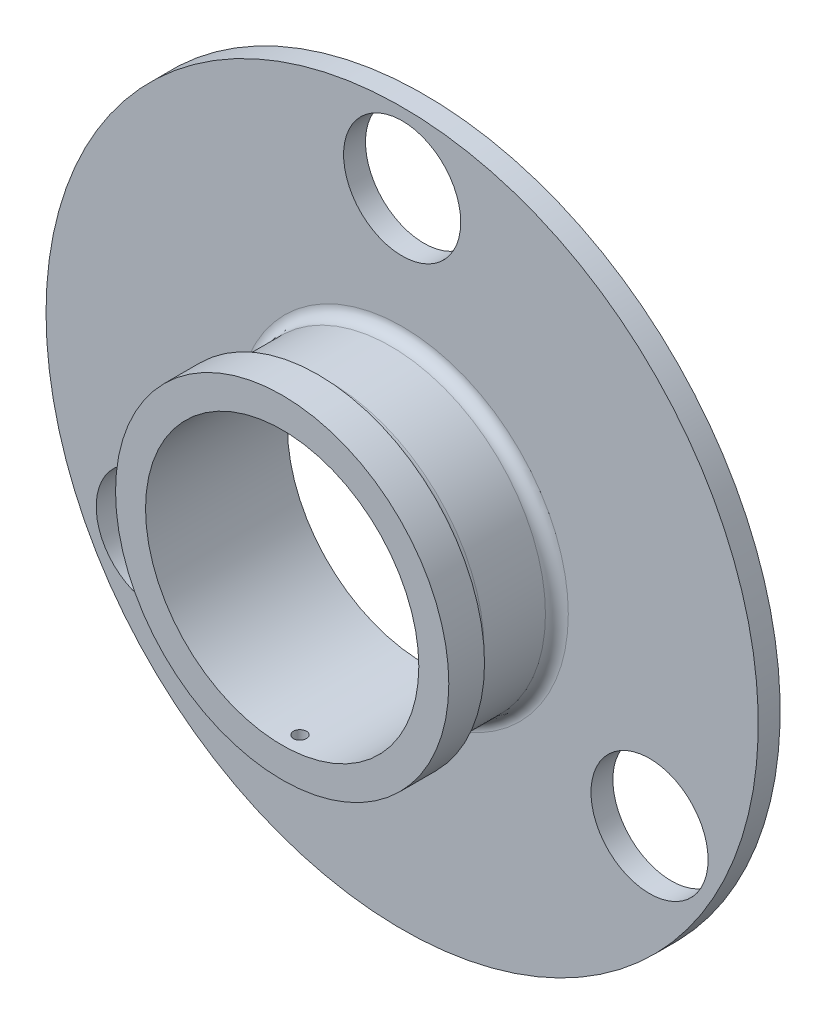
ISO-10303-21;
HEADER;
FILE_DESCRIPTION(('STEP AP214'),'2;1');
FILE_NAME('part.step','',(''),(''),'','','');
FILE_SCHEMA(('AUTOMOTIVE_DESIGN { 1 0 10303 214 1 1 1 1 }'));
ENDSEC;
DATA;
#1=APPLICATION_CONTEXT('core data for automotive mechanical design processes');
#2=APPLICATION_PROTOCOL_DEFINITION('international standard','automotive_design',2000,#1);
#3=PRODUCT_CONTEXT('',#1,'mechanical');
#4=PRODUCT('Part','Part','',(#3));
#5=PRODUCT_RELATED_PRODUCT_CATEGORY('part','',(#4));
#6=PRODUCT_DEFINITION_FORMATION('','',#4);
#7=PRODUCT_DEFINITION_CONTEXT('part definition',#1,'design');
#8=PRODUCT_DEFINITION('design','',#6,#7);
#9=PRODUCT_DEFINITION_SHAPE('','',#8);
#10=(LENGTH_UNIT() NAMED_UNIT(*) SI_UNIT(.MILLI.,.METRE.));
#11=(NAMED_UNIT(*) PLANE_ANGLE_UNIT() SI_UNIT($,.RADIAN.));
#12=(NAMED_UNIT(*) SI_UNIT($,.STERADIAN.) SOLID_ANGLE_UNIT());
#13=UNCERTAINTY_MEASURE_WITH_UNIT(LENGTH_MEASURE(1.E-05),#10,'distance_accuracy_value','');
#14=(GEOMETRIC_REPRESENTATION_CONTEXT(3) GLOBAL_UNCERTAINTY_ASSIGNED_CONTEXT((#13)) GLOBAL_UNIT_ASSIGNED_CONTEXT((#10,
#11,#12)) REPRESENTATION_CONTEXT('',''));
#15=CARTESIAN_POINT('',(0.,0.,0.));
#16=DIRECTION('',(0.,0.,1.));
#17=DIRECTION('',(1.,0.,0.));
#18=AXIS2_PLACEMENT_3D('',#15,#16,#17);
#19=CARTESIAN_POINT('',(0.,0.,0.));
#20=DIRECTION('',(0.,0.,-1.));
#21=DIRECTION('',(-1.,0.,0.));
#22=AXIS2_PLACEMENT_3D('',#19,#20,#21);
#23=CYLINDRICAL_SURFACE('',#22,36.449);
#24=CARTESIAN_POINT('',(0.,-36.449,31.3563));
#25=CARTESIAN_POINT('',(0.0969591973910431,-36.4489994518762,31.3563042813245));
#26=CARTESIAN_POINT('',(0.193987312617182,-36.4486089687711,31.3644918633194));
#27=CARTESIAN_POINT('',(0.385367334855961,-36.4470887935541,31.3970378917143));
#28=CARTESIAN_POINT('',(0.479715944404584,-36.4459582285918,31.4214154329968));
#29=CARTESIAN_POINT('',(0.662936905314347,-36.4430858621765,31.4856422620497));
#30=CARTESIAN_POINT('',(0.751812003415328,-36.4413443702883,31.5254837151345));
#31=CARTESIAN_POINT('',(0.921588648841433,-36.4374463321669,31.6194955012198));
#32=CARTESIAN_POINT('',(1.00249208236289,-36.4352898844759,31.6736624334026));
#33=CARTESIAN_POINT('',(1.15412766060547,-36.4308023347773,31.7948434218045));
#34=CARTESIAN_POINT('',(1.22485156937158,-36.428471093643,31.8618677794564));
#35=CARTESIAN_POINT('',(1.35405039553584,-36.4238979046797,32.0068406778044));
#36=CARTESIAN_POINT('',(1.41252481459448,-36.4216559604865,32.084789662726));
#37=CARTESIAN_POINT('',(1.5155867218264,-36.4175132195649,32.2494413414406));
#38=CARTESIAN_POINT('',(1.56016789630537,-36.415612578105,32.3361479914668));
#39=CARTESIAN_POINT('',(1.63413727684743,-36.4123684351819,32.5158258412));
#40=CARTESIAN_POINT('',(1.66352558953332,-36.4110249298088,32.6087969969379));
#41=CARTESIAN_POINT('',(1.70625358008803,-36.4090477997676,32.798290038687));
#42=CARTESIAN_POINT('',(1.71960541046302,-36.4084136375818,32.8948091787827));
#43=CARTESIAN_POINT('',(1.72991891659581,-36.4079250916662,33.0887207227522));
#44=CARTESIAN_POINT('',(1.72688071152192,-36.4080707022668,33.1861131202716));
#45=CARTESIAN_POINT('',(1.70451052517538,-36.4091247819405,33.3789239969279));
#46=CARTESIAN_POINT('',(1.68519167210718,-36.4100326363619,33.4743440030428));
#47=CARTESIAN_POINT('',(1.63082892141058,-36.4125079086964,33.6605851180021));
#48=CARTESIAN_POINT('',(1.5957849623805,-36.414075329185,33.7514062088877));
#49=CARTESIAN_POINT('',(1.51095176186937,-36.417693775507,33.9259137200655));
#50=CARTESIAN_POINT('',(1.46115652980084,-36.4197449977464,34.0095972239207));
#51=CARTESIAN_POINT('',(1.34823865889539,-36.4240996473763,34.1674221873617));
#52=CARTESIAN_POINT('',(1.28511593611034,-36.4264030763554,34.2415635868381));
#53=CARTESIAN_POINT('',(1.14726079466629,-36.4310052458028,34.378276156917));
#54=CARTESIAN_POINT('',(1.07251700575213,-36.4333039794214,34.4408358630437));
#55=CARTESIAN_POINT('',(0.913581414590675,-36.4376354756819,34.5525208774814));
#56=CARTESIAN_POINT('',(0.829389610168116,-36.4396682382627,34.6016461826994));
#57=CARTESIAN_POINT('',(0.653941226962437,-36.4432387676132,34.6850667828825));
#58=CARTESIAN_POINT('',(0.562684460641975,-36.4447765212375,34.7193616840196));
#59=CARTESIAN_POINT('',(0.375699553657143,-36.4471835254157,34.7721405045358));
#60=CARTESIAN_POINT('',(0.279971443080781,-36.4480527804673,34.7906245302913));
#61=CARTESIAN_POINT('',(0.0868607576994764,-36.4490242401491,34.811242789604));
#62=CARTESIAN_POINT('',(-0.0105201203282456,-36.4491271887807,34.8133928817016));
#63=CARTESIAN_POINT('',(-0.204259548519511,-36.4485564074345,34.8013236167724));
#64=CARTESIAN_POINT('',(-0.30061810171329,-36.4478826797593,34.7871043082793));
#65=CARTESIAN_POINT('',(-0.489533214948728,-36.4458349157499,34.7427130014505));
#66=CARTESIAN_POINT('',(-0.582091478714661,-36.4444611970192,34.7125482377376));
#67=CARTESIAN_POINT('',(-0.760831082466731,-36.4411681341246,34.6371296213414));
#68=CARTESIAN_POINT('',(-0.847012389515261,-36.4392487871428,34.5918756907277));
#69=CARTESIAN_POINT('',(-1.01062455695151,-36.4350785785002,34.4875226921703));
#70=CARTESIAN_POINT('',(-1.08804862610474,-36.4328274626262,34.428412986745));
#71=CARTESIAN_POINT('',(-1.23188026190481,-36.4282481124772,34.2980418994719));
#72=CARTESIAN_POINT('',(-1.29828776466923,-36.4259198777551,34.2267804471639));
#73=CARTESIAN_POINT('',(-1.41825452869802,-36.4214465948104,34.0740605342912));
#74=CARTESIAN_POINT('',(-1.47180353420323,-36.4193016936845,33.9925940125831));
#75=CARTESIAN_POINT('',(-1.56446315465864,-36.4154392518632,33.8218172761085));
#76=CARTESIAN_POINT('',(-1.60357382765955,-36.4137217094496,33.73250709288));
#77=CARTESIAN_POINT('',(-1.66622867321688,-36.410908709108,33.5486163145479));
#78=CARTESIAN_POINT('',(-1.68977939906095,-36.4098129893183,33.4540379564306));
#79=CARTESIAN_POINT('',(-1.72066727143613,-36.4083664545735,33.262264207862));
#80=CARTESIAN_POINT('',(-1.72800449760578,-36.4080156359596,33.1650688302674));
#81=CARTESIAN_POINT('',(-1.72625632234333,-36.4080985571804,32.9709221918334));
#82=CARTESIAN_POINT('',(-1.71718705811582,-36.4085315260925,32.8739707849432));
#83=CARTESIAN_POINT('',(-1.68291668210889,-36.4101315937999,32.6829686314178));
#84=CARTESIAN_POINT('',(-1.6577155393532,-36.4112986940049,32.5889178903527));
#85=CARTESIAN_POINT('',(-1.59189998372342,-36.4142353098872,32.4063832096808));
#86=CARTESIAN_POINT('',(-1.55128542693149,-36.4160048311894,32.3178993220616));
#87=CARTESIAN_POINT('',(-1.45579890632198,-36.4199467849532,32.1490056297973));
#88=CARTESIAN_POINT('',(-1.4009273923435,-36.4221192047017,32.0685955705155));
#89=CARTESIAN_POINT('',(-1.27842740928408,-36.4266245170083,31.9180518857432));
#90=CARTESIAN_POINT('',(-1.21078782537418,-36.4289575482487,31.8479273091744));
#91=CARTESIAN_POINT('',(-1.06467652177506,-36.433520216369,31.7200072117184));
#92=CARTESIAN_POINT('',(-0.986202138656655,-36.4357498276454,31.6622147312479));
#93=CARTESIAN_POINT('',(-0.820592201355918,-36.4398558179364,31.560575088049));
#94=CARTESIAN_POINT('',(-0.733448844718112,-36.44173187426,31.5167406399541));
#95=CARTESIAN_POINT('',(-0.553096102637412,-36.4449144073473,31.4443770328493));
#96=CARTESIAN_POINT('',(-0.45989404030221,-36.4462215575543,31.4158297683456));
#97=CARTESIAN_POINT('',(-0.305092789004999,-36.4477726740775,31.3823512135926));
#98=CARTESIAN_POINT('',(-0.244496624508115,-36.4482309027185,31.3725944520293));
#99=CARTESIAN_POINT('',(-0.122609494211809,-36.4488447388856,31.3595674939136));
#100=CARTESIAN_POINT('',(-0.0613185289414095,-36.4490003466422,31.3562972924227));
#101=CARTESIAN_POINT('',(0.,-36.449,31.3563));
#102=B_SPLINE_CURVE_WITH_KNOTS('',3,(#24,#25,#26,#27,#28,#29,#30,#31,#32,#33,#34,#35,#36,#37,
#38,#39,#40,#41,#42,#43,#44,#45,#46,#47,#48,#49,#50,#51,#52,#53,#54,#55,#56,#57,#58,#59,#60,#61,
#62,#63,#64,#65,#66,#67,#68,#69,#70,#71,#72,#73,#74,#75,#76,#77,#78,#79,#80,#81,#82,#83,#84,#85,
#86,#87,#88,#89,#90,#91,#92,#93,#94,#95,#96,#97,#98,#99,#100,#101),.UNSPECIFIED.,.T.,.F.,(4,2,2,
2,2,2,2,2,2,2,2,2,2,2,2,2,2,2,2,2,2,2,2,2,2,2,2,2,2,2,2,2,2,2,2,2,2,2,4),(0.,0.290653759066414,
0.581650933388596,0.872500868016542,1.16328181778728,1.45429672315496,1.74532346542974,
2.03648227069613,2.32763903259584,2.6185750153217,2.90950888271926,3.20020837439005,
3.49090900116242,3.7817278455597,4.07254852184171,4.36365555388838,4.65476265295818,
4.9458774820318,5.23699035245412,5.5278205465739,5.81864987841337,6.10934737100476,
6.40004636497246,6.69096927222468,6.98189386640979,7.2730497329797,7.56420442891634,
7.85523642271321,8.14626698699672,8.43701145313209,8.72775647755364,9.01850421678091,
9.30924278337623,9.6002356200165,9.89130011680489,10.1826289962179,10.4736120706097,
10.6574262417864,10.8412402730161),.UNSPECIFIED.);
#103=CARTESIAN_POINT('',(0.,-36.449,31.3563));
#104=VERTEX_POINT('',#103);
#105=EDGE_CURVE('E97',#104,#104,#102,.T.);
#106=ORIENTED_EDGE('',*,*,#105,.T.);
#107=EDGE_LOOP('',(#106));
#108=FACE_BOUND('',#107,.T.);
#109=CARTESIAN_POINT('',(0.,0.,37.846));
#110=DIRECTION('',(0.,0.,-1.));
#111=DIRECTION('',(-1.,0.,0.));
#112=AXIS2_PLACEMENT_3D('',#109,#110,#111);
#113=CIRCLE('',#112,36.449);
#114=CARTESIAN_POINT('',(-36.449,0.,37.846));
#115=VERTEX_POINT('',#114);
#116=EDGE_CURVE('E10',#115,#115,#113,.T.);
#117=ORIENTED_EDGE('',*,*,#116,.F.);
#118=EDGE_LOOP('',(#117));
#119=FACE_BOUND('',#118,.T.);
#120=CARTESIAN_POINT('',(0.,0.,0.));
#121=DIRECTION('',(0.,0.,-1.));
#122=DIRECTION('',(-1.,0.,0.));
#123=AXIS2_PLACEMENT_3D('',#120,#121,#122);
#124=CIRCLE('',#123,36.449);
#125=CARTESIAN_POINT('',(-36.449,0.,0.));
#126=VERTEX_POINT('',#125);
#127=EDGE_CURVE('E69',#126,#126,#124,.T.);
#128=ORIENTED_EDGE('',*,*,#127,.T.);
#129=EDGE_LOOP('',(#128));
#130=FACE_BOUND('',#129,.T.);
#131=ADVANCED_FACE('F35',(#108,#119,#130),#23,.F.);
#132=CARTESIAN_POINT('',(44.45,0.,37.846));
#133=DIRECTION('',(0.,0.,-1.));
#134=DIRECTION('',(-1.,0.,0.));
#135=AXIS2_PLACEMENT_3D('',#132,#133,#134);
#136=PLANE('',#135);
#137=CARTESIAN_POINT('',(0.,0.,37.846));
#138=DIRECTION('',(0.,0.,-1.));
#139=DIRECTION('',(-1.,0.,0.));
#140=AXIS2_PLACEMENT_3D('',#137,#138,#139);
#141=CIRCLE('',#140,44.45);
#142=CARTESIAN_POINT('',(-44.45,0.,37.846));
#143=VERTEX_POINT('',#142);
#144=EDGE_CURVE('E41',#143,#143,#141,.T.);
#145=ORIENTED_EDGE('',*,*,#144,.F.);
#146=EDGE_LOOP('',(#145));
#147=FACE_BOUND('',#146,.T.);
#148=ORIENTED_EDGE('',*,*,#116,.T.);
#149=EDGE_LOOP('',(#148));
#150=FACE_BOUND('',#149,.T.);
#151=ADVANCED_FACE('F152',(#147,#150),#136,.F.);
#152=CARTESIAN_POINT('',(0.,0.,0.));
#153=DIRECTION('',(0.,0.,-1.));
#154=DIRECTION('',(-1.,0.,0.));
#155=AXIS2_PLACEMENT_3D('',#152,#153,#154);
#156=CYLINDRICAL_SURFACE('',#155,44.45);
#157=CARTESIAN_POINT('',(0.,-44.45,31.3563));
#158=CARTESIAN_POINT('',(-0.0969783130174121,-44.4499995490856,31.35630428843));
#159=CARTESIAN_POINT('',(-0.19402601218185,-44.4496792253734,31.364495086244));
#160=CARTESIAN_POINT('',(-0.38544597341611,-44.4484321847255,31.397054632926));
#161=CARTESIAN_POINT('',(-0.479814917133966,-44.447504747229,31.4214426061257));
#162=CARTESIAN_POINT('',(-0.66307664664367,-44.4451484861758,31.4856987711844));
#163=CARTESIAN_POINT('',(-0.751972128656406,-44.4437199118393,31.5255592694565));
#164=CARTESIAN_POINT('',(-0.921785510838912,-44.4405224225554,31.619617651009));
#165=CARTESIAN_POINT('',(-1.00270532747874,-44.4387535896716,31.6738120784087));
#166=CARTESIAN_POINT('',(-1.15434895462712,-44.4350733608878,31.7950411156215));
#167=CARTESIAN_POINT('',(-1.22506686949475,-44.4331618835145,31.8620830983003));
#168=CARTESIAN_POINT('',(-1.35424930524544,-44.4294125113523,32.0070902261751));
#169=CARTESIAN_POINT('',(-1.41271333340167,-44.4275746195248,32.0850558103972));
#170=CARTESIAN_POINT('',(-1.51574171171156,-44.4241791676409,32.2497241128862));
#171=CARTESIAN_POINT('',(-1.5603019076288,-44.4226216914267,32.3364294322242));
#172=CARTESIAN_POINT('',(-1.63423093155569,-44.4199635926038,32.5160975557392));
#173=CARTESIAN_POINT('',(-1.66359984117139,-44.4188629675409,32.6090603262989));
#174=CARTESIAN_POINT('',(-1.70629826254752,-44.417243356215,32.7985543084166));
#175=CARTESIAN_POINT('',(-1.71963593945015,-44.4167240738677,32.8950836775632));
#176=CARTESIAN_POINT('',(-1.72991846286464,-44.4163248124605,33.0890125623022));
#177=CARTESIAN_POINT('',(-1.72686339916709,-44.4164448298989,33.1864120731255));
#178=CARTESIAN_POINT('',(-1.70445400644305,-44.4173103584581,33.3792610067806));
#179=CARTESIAN_POINT('',(-1.68510849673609,-44.4180555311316,33.4747114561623));
#180=CARTESIAN_POINT('',(-1.63068101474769,-44.4200868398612,33.6610089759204));
#181=CARTESIAN_POINT('',(-1.59559899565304,-44.4213729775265,33.7518560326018));
#182=CARTESIAN_POINT('',(-1.51068423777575,-44.424341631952,33.9263963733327));
#183=CARTESIAN_POINT('',(-1.46084746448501,-44.4260242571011,34.0100876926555));
#184=CARTESIAN_POINT('',(-1.34784084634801,-44.4295961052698,34.1679193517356));
#185=CARTESIAN_POINT('',(-1.2846709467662,-44.4314853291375,34.2420596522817));
#186=CARTESIAN_POINT('',(-1.14674139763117,-44.435258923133,34.3787360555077));
#187=CARTESIAN_POINT('',(-1.07197410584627,-44.4371432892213,34.4412644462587));
#188=CARTESIAN_POINT('',(-0.912999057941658,-44.4406935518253,34.5528826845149));
#189=CARTESIAN_POINT('',(-0.828791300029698,-44.4423594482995,34.6019725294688));
#190=CARTESIAN_POINT('',(-0.653321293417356,-44.4452850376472,34.6853193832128));
#191=CARTESIAN_POINT('',(-0.562058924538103,-44.4465447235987,34.7195761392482));
#192=CARTESIAN_POINT('',(-0.375072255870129,-44.4485157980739,34.7722794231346));
#193=CARTESIAN_POINT('',(-0.279347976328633,-44.4492271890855,34.7907260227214));
#194=CARTESIAN_POINT('',(-0.0862217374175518,-44.4500211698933,34.8112758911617));
#195=CARTESIAN_POINT('',(0.0111790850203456,-44.4501041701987,34.8133898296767));
#196=CARTESIAN_POINT('',(0.204952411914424,-44.4496331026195,34.801242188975));
#197=CARTESIAN_POINT('',(0.30132491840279,-44.4490790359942,34.786980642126));
#198=CARTESIAN_POINT('',(0.490276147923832,-44.4473965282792,34.7424956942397));
#199=CARTESIAN_POINT('',(0.582856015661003,-44.4462682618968,34.7122771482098));
#200=CARTESIAN_POINT('',(0.761629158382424,-44.4435644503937,34.6367409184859));
#201=CARTESIAN_POINT('',(0.847822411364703,-44.4419889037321,34.591423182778));
#202=CARTESIAN_POINT('',(1.0114246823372,-44.4385669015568,34.4869475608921));
#203=CARTESIAN_POINT('',(1.08882911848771,-44.4367203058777,34.4277825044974));
#204=CARTESIAN_POINT('',(1.23261049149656,-44.4329647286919,34.2973022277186));
#205=CARTESIAN_POINT('',(1.29898738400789,-44.4310557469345,34.225986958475));
#206=CARTESIAN_POINT('',(1.41886522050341,-44.4273894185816,34.0731848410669));
#207=CARTESIAN_POINT('',(1.47235927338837,-44.4256321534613,33.9916925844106));
#208=CARTESIAN_POINT('',(1.56490583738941,-44.4224686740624,33.8208772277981));
#209=CARTESIAN_POINT('',(1.60395839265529,-44.4210624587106,33.7315541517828));
#210=CARTESIAN_POINT('',(1.66650134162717,-44.4187602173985,33.5476384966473));
#211=CARTESIAN_POINT('',(1.68999616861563,-44.4178640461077,33.4530474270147));
#212=CARTESIAN_POINT('',(1.72077124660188,-44.4166825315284,33.2612596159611));
#213=CARTESIAN_POINT('',(1.72805154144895,-44.416397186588,33.1640628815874));
#214=CARTESIAN_POINT('',(1.72619039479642,-44.416469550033,32.9698915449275));
#215=CARTESIAN_POINT('',(1.71705980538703,-44.4168268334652,32.8729168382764));
#216=CARTESIAN_POINT('',(1.6826584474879,-44.41814328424,32.6818779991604));
#217=CARTESIAN_POINT('',(1.65738764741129,-44.4191024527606,32.5878138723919));
#218=CARTESIAN_POINT('',(1.59142513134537,-44.4215144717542,32.4052632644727));
#219=CARTESIAN_POINT('',(1.55073319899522,-44.4229673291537,32.3167768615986));
#220=CARTESIAN_POINT('',(1.45508607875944,-44.4262029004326,32.1478924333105));
#221=CARTESIAN_POINT('',(1.40013137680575,-44.4279856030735,32.0674941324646));
#222=CARTESIAN_POINT('',(1.27748233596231,-44.4316812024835,31.9170155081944));
#223=CARTESIAN_POINT('',(1.20978095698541,-44.4335941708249,31.8469409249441));
#224=CARTESIAN_POINT('',(1.06355515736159,-44.4373343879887,31.7191318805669));
#225=CARTESIAN_POINT('',(0.98502806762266,-44.4391616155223,31.6614004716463));
#226=CARTESIAN_POINT('',(0.819337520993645,-44.4425252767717,31.559900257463));
#227=CARTESIAN_POINT('',(0.732167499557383,-44.444061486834,31.5161421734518));
#228=CARTESIAN_POINT('',(0.551778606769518,-44.4466662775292,31.4439337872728));
#229=CARTESIAN_POINT('',(0.45856707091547,-44.4477354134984,31.415465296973));
#230=CARTESIAN_POINT('',(0.303975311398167,-44.4490009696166,31.3821593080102));
#231=CARTESIAN_POINT('',(0.243597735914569,-44.4493739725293,31.372474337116));
#232=CARTESIAN_POINT('',(0.122155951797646,-44.4498736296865,31.3595433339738));
#233=CARTESIAN_POINT('',(0.0610917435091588,-44.4500002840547,31.3562972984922));
#234=CARTESIAN_POINT('',(0.,-44.45,31.3563));
#235=B_SPLINE_CURVE_WITH_KNOTS('',3,(#157,#158,#159,#160,#161,#162,#163,#164,#165,#166,#167,
#168,#169,#170,#171,#172,#173,#174,#175,#176,#177,#178,#179,#180,#181,#182,#183,#184,#185,#186,
#187,#188,#189,#190,#191,#192,#193,#194,#195,#196,#197,#198,#199,#200,#201,#202,#203,#204,#205,
#206,#207,#208,#209,#210,#211,#212,#213,#214,#215,#216,#217,#218,#219,#220,#221,#222,#223,#224,
#225,#226,#227,#228,#229,#230,#231,#232,#233,#234),.UNSPECIFIED.,.T.,.F.,(4,2,2,2,2,2,2,2,2,2,2,
2,2,2,2,2,2,2,2,2,2,2,2,2,2,2,2,2,2,2,2,2,2,2,2,2,2,2,4),(0.,0.290711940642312,
0.581769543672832,0.872682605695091,1.16352559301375,1.45453598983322,1.74555808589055,
2.03666705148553,2.32777445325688,2.61873352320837,2.90969099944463,3.20049105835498,
3.49129198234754,3.78217249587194,4.07305420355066,4.36412841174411,4.65520267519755,
4.94628189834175,5.23735980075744,5.5282475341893,5.81913469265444,6.10993339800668,
6.40073310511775,6.69168372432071,6.98263551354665,7.27374259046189,7.5648487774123,
7.8558719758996,8.14689438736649,8.43772442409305,8.72855502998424,9.01938971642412,
9.31021449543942,9.60120037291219,9.89225812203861,10.1835386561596,10.4744719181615,
10.6576067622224,10.8407415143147),.UNSPECIFIED.);
#236=CARTESIAN_POINT('',(0.,-44.45,31.3563));
#237=VERTEX_POINT('',#236);
#238=EDGE_CURVE('E90',#237,#237,#235,.T.);
#239=ORIENTED_EDGE('',*,*,#238,.T.);
#240=EDGE_LOOP('',(#239));
#241=FACE_BOUND('',#240,.T.);
#242=CARTESIAN_POINT('',(0.,0.,28.321));
#243=DIRECTION('',(0.,0.,-1.));
#244=DIRECTION('',(-1.,0.,0.));
#245=AXIS2_PLACEMENT_3D('',#242,#243,#244);
#246=CIRCLE('',#245,44.45);
#247=CARTESIAN_POINT('',(-44.45,0.,28.321));
#248=VERTEX_POINT('',#247);
#249=EDGE_CURVE('E45',#248,#248,#246,.T.);
#250=ORIENTED_EDGE('',*,*,#249,.F.);
#251=EDGE_LOOP('',(#250));
#252=FACE_BOUND('',#251,.T.);
#253=ORIENTED_EDGE('',*,*,#144,.T.);
#254=EDGE_LOOP('',(#253));
#255=FACE_BOUND('',#254,.T.);
#256=ADVANCED_FACE('F101',(#241,#252,#255),#156,.T.);
#257=CARTESIAN_POINT('',(44.323,0.,28.321));
#258=DIRECTION('',(0.,0.,1.));
#259=DIRECTION('',(1.,0.,0.));
#260=AXIS2_PLACEMENT_3D('',#257,#258,#259);
#261=PLANE('',#260);
#262=CARTESIAN_POINT('',(0.,0.,28.321));
#263=DIRECTION('',(0.,0.,-1.));
#264=DIRECTION('',(-1.,0.,0.));
#265=AXIS2_PLACEMENT_3D('',#262,#263,#264);
#266=CIRCLE('',#265,44.323);
#267=CARTESIAN_POINT('',(-44.323,0.,28.321));
#268=VERTEX_POINT('',#267);
#269=EDGE_CURVE('E49',#268,#268,#266,.T.);
#270=ORIENTED_EDGE('',*,*,#269,.F.);
#271=EDGE_LOOP('',(#270));
#272=FACE_BOUND('',#271,.T.);
#273=ORIENTED_EDGE('',*,*,#249,.T.);
#274=EDGE_LOOP('',(#273));
#275=FACE_BOUND('',#274,.T.);
#276=ADVANCED_FACE('F145',(#272,#275),#261,.F.);
#277=CARTESIAN_POINT('',(0.,0.,25.273));
#278=DIRECTION('',(0.,0.,-1.));
#279=DIRECTION('',(-1.,0.,0.));
#280=AXIS2_PLACEMENT_3D('',#277,#278,#279);
#281=TOROIDAL_SURFACE('',#280,44.323,3.048);
#282=CARTESIAN_POINT('',(0.,0.,25.273));
#283=DIRECTION('',(0.,0.,-1.));
#284=DIRECTION('',(-1.,0.,0.));
#285=AXIS2_PLACEMENT_3D('',#282,#283,#284);
#286=CIRCLE('',#285,41.275);
#287=CARTESIAN_POINT('',(-41.275,0.,25.273));
#288=VERTEX_POINT('',#287);
#289=EDGE_CURVE('E54',#288,#288,#286,.T.);
#290=ORIENTED_EDGE('',*,*,#289,.F.);
#291=EDGE_LOOP('',(#290));
#292=FACE_BOUND('',#291,.T.);
#293=ORIENTED_EDGE('',*,*,#269,.T.);
#294=EDGE_LOOP('',(#293));
#295=FACE_BOUND('',#294,.T.);
#296=ADVANCED_FACE('F142',(#292,#295),#281,.F.);
#297=CARTESIAN_POINT('',(0.,0.,0.));
#298=DIRECTION('',(0.,0.,-1.));
#299=DIRECTION('',(-1.,0.,0.));
#300=AXIS2_PLACEMENT_3D('',#297,#298,#299);
#301=CYLINDRICAL_SURFACE('',#300,41.275);
#302=CARTESIAN_POINT('',(0.,0.,8.89000000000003));
#303=DIRECTION('',(0.,0.,-1.));
#304=DIRECTION('',(-1.,0.,0.));
#305=AXIS2_PLACEMENT_3D('',#302,#303,#304);
#306=CIRCLE('',#305,41.275);
#307=CARTESIAN_POINT('',(-41.275,0.,8.89000000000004));
#308=VERTEX_POINT('',#307);
#309=EDGE_CURVE('E57',#308,#308,#306,.T.);
#310=ORIENTED_EDGE('',*,*,#309,.F.);
#311=EDGE_LOOP('',(#310));
#312=FACE_BOUND('',#311,.T.);
#313=ORIENTED_EDGE('',*,*,#289,.T.);
#314=EDGE_LOOP('',(#313));
#315=FACE_BOUND('',#314,.T.);
#316=ADVANCED_FACE('F138',(#312,#315),#301,.T.);
#317=CARTESIAN_POINT('',(0.,0.,8.89000000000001));
#318=DIRECTION('',(0.,0.,-1.));
#319=DIRECTION('',(-1.,0.,0.));
#320=AXIS2_PLACEMENT_3D('',#317,#318,#319);
#321=TOROIDAL_SURFACE('',#320,44.323,3.048);
#322=CARTESIAN_POINT('',(0.,0.,5.84200000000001));
#323=DIRECTION('',(0.,0.,-1.));
#324=DIRECTION('',(-1.,0.,0.));
#325=AXIS2_PLACEMENT_3D('',#322,#323,#324);
#326=CIRCLE('',#325,44.323);
#327=CARTESIAN_POINT('',(-44.323,0.,5.84200000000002));
#328=VERTEX_POINT('',#327);
#329=EDGE_CURVE('E60',#328,#328,#326,.T.);
#330=ORIENTED_EDGE('',*,*,#329,.F.);
#331=EDGE_LOOP('',(#330));
#332=FACE_BOUND('',#331,.T.);
#333=ORIENTED_EDGE('',*,*,#309,.T.);
#334=EDGE_LOOP('',(#333));
#335=FACE_BOUND('',#334,.T.);
#336=ADVANCED_FACE('F134',(#332,#335),#321,.F.);
#337=CARTESIAN_POINT('',(94.996,0.,5.842));
#338=DIRECTION('',(0.,0.,-1.));
#339=DIRECTION('',(-1.,0.,0.));
#340=AXIS2_PLACEMENT_3D('',#337,#338,#339);
#341=PLANE('',#340);
#342=CARTESIAN_POINT('',(65.9911357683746,-38.0999999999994,5.84200000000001));
#343=DIRECTION('',(0.,0.,1.));
#344=DIRECTION('',(-0.499999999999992,-0.866025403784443,0.));
#345=AXIS2_PLACEMENT_3D('',#342,#343,#344);
#346=CIRCLE('',#345,15.621);
#347=CARTESIAN_POINT('',(58.1806357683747,-51.6281828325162,5.84200000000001));
#348=VERTEX_POINT('',#347);
#349=EDGE_CURVE('E87',#348,#348,#346,.T.);
#350=ORIENTED_EDGE('',*,*,#349,.F.);
#351=EDGE_LOOP('',(#350));
#352=FACE_BOUND('',#351,.T.);
#353=CARTESIAN_POINT('',(-65.9911357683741,-38.1000000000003,5.84200000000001));
#354=DIRECTION('',(0.,0.,1.));
#355=DIRECTION('',(-0.500000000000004,0.866025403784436,0.));
#356=AXIS2_PLACEMENT_3D('',#353,#354,#355);
#357=CIRCLE('',#356,15.621);
#358=CARTESIAN_POINT('',(-73.8016357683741,-24.5718171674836,5.84200000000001));
#359=VERTEX_POINT('',#358);
#360=EDGE_CURVE('E81',#359,#359,#357,.T.);
#361=ORIENTED_EDGE('',*,*,#360,.F.);
#362=EDGE_LOOP('',(#361));
#363=FACE_BOUND('',#362,.T.);
#364=CARTESIAN_POINT('',(0.,76.2,5.84200000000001));
#365=DIRECTION('',(0.,0.,1.));
#366=DIRECTION('',(1.,0.,0.));
#367=AXIS2_PLACEMENT_3D('',#364,#365,#366);
#368=CIRCLE('',#367,15.621);
#369=CARTESIAN_POINT('',(15.621,76.2,5.84200000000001));
#370=VERTEX_POINT('',#369);
#371=EDGE_CURVE('E75',#370,#370,#368,.T.);
#372=ORIENTED_EDGE('',*,*,#371,.F.);
#373=EDGE_LOOP('',(#372));
#374=FACE_BOUND('',#373,.T.);
#375=CARTESIAN_POINT('',(0.,0.,5.84200000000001));
#376=DIRECTION('',(0.,0.,-1.));
#377=DIRECTION('',(-1.,0.,0.));
#378=AXIS2_PLACEMENT_3D('',#375,#376,#377);
#379=CIRCLE('',#378,94.996);
#380=CARTESIAN_POINT('',(-94.996,0.,5.84200000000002));
#381=VERTEX_POINT('',#380);
#382=EDGE_CURVE('E63',#381,#381,#379,.T.);
#383=ORIENTED_EDGE('',*,*,#382,.F.);
#384=EDGE_LOOP('',(#383));
#385=FACE_BOUND('',#384,.T.);
#386=ORIENTED_EDGE('',*,*,#329,.T.);
#387=EDGE_LOOP('',(#386));
#388=FACE_BOUND('',#387,.T.);
#389=ADVANCED_FACE('F130',(#352,#363,#374,#385,#388),#341,.F.);
#390=CARTESIAN_POINT('',(0.,0.,0.));
#391=DIRECTION('',(0.,0.,-1.));
#392=DIRECTION('',(-1.,0.,0.));
#393=AXIS2_PLACEMENT_3D('',#390,#391,#392);
#394=CYLINDRICAL_SURFACE('',#393,94.996);
#395=CARTESIAN_POINT('',(0.,0.,0.));
#396=DIRECTION('',(0.,0.,-1.));
#397=DIRECTION('',(-1.,0.,0.));
#398=AXIS2_PLACEMENT_3D('',#395,#396,#397);
#399=CIRCLE('',#398,94.996);
#400=CARTESIAN_POINT('',(-94.996,0.,0.));
#401=VERTEX_POINT('',#400);
#402=EDGE_CURVE('E66',#401,#401,#399,.T.);
#403=ORIENTED_EDGE('',*,*,#402,.F.);
#404=EDGE_LOOP('',(#403));
#405=FACE_BOUND('',#404,.T.);
#406=ORIENTED_EDGE('',*,*,#382,.T.);
#407=EDGE_LOOP('',(#406));
#408=FACE_BOUND('',#407,.T.);
#409=ADVANCED_FACE('F126',(#405,#408),#394,.T.);
#410=CARTESIAN_POINT('',(36.449,0.,0.));
#411=DIRECTION('',(0.,0.,1.));
#412=DIRECTION('',(1.,0.,0.));
#413=AXIS2_PLACEMENT_3D('',#410,#411,#412);
#414=PLANE('',#413);
#415=CARTESIAN_POINT('',(65.9911357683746,-38.0999999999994,0.));
#416=DIRECTION('',(0.,0.,1.));
#417=DIRECTION('',(1.,0.,0.));
#418=AXIS2_PLACEMENT_3D('',#415,#416,#417);
#419=CIRCLE('',#418,15.621);
#420=CARTESIAN_POINT('',(81.6121357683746,-38.0999999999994,0.));
#421=VERTEX_POINT('',#420);
#422=EDGE_CURVE('E84',#421,#421,#419,.F.);
#423=ORIENTED_EDGE('',*,*,#422,.F.);
#424=EDGE_LOOP('',(#423));
#425=FACE_BOUND('',#424,.T.);
#426=CARTESIAN_POINT('',(-65.9911357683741,-38.1000000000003,0.));
#427=DIRECTION('',(0.,0.,1.));
#428=DIRECTION('',(1.,0.,0.));
#429=AXIS2_PLACEMENT_3D('',#426,#427,#428);
#430=CIRCLE('',#429,15.621);
#431=CARTESIAN_POINT('',(-50.3701357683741,-38.1000000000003,0.));
#432=VERTEX_POINT('',#431);
#433=EDGE_CURVE('E78',#432,#432,#430,.F.);
#434=ORIENTED_EDGE('',*,*,#433,.F.);
#435=EDGE_LOOP('',(#434));
#436=FACE_BOUND('',#435,.T.);
#437=CARTESIAN_POINT('',(0.,76.2,0.));
#438=DIRECTION('',(0.,0.,1.));
#439=DIRECTION('',(1.,0.,0.));
#440=AXIS2_PLACEMENT_3D('',#437,#438,#439);
#441=CIRCLE('',#440,15.621);
#442=CARTESIAN_POINT('',(15.621,76.2,0.));
#443=VERTEX_POINT('',#442);
#444=EDGE_CURVE('E72',#443,#443,#441,.F.);
#445=ORIENTED_EDGE('',*,*,#444,.F.);
#446=EDGE_LOOP('',(#445));
#447=FACE_BOUND('',#446,.T.);
#448=ORIENTED_EDGE('',*,*,#127,.F.);
#449=EDGE_LOOP('',(#448));
#450=FACE_BOUND('',#449,.T.);
#451=ORIENTED_EDGE('',*,*,#402,.T.);
#452=EDGE_LOOP('',(#451));
#453=FACE_BOUND('',#452,.T.);
#454=ADVANCED_FACE('F122',(#425,#436,#447,#450,#453),#414,.F.);
#455=CARTESIAN_POINT('',(0.,76.2,-0.00100000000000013));
#456=DIRECTION('',(0.,0.,1.));
#457=DIRECTION('',(1.,0.,0.));
#458=AXIS2_PLACEMENT_3D('',#455,#456,#457);
#459=CYLINDRICAL_SURFACE('',#458,15.621);
#460=ORIENTED_EDGE('',*,*,#371,.T.);
#461=EDGE_LOOP('',(#460));
#462=FACE_BOUND('',#461,.T.);
#463=ORIENTED_EDGE('',*,*,#444,.T.);
#464=EDGE_LOOP('',(#463));
#465=FACE_BOUND('',#464,.T.);
#466=ADVANCED_FACE('F118',(#462,#465),#459,.F.);
#467=CARTESIAN_POINT('',(-65.9911357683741,-38.1000000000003,-0.00100000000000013));
#468=DIRECTION('',(0.,0.,1.));
#469=DIRECTION('',(1.,0.,0.));
#470=AXIS2_PLACEMENT_3D('',#467,#468,#469);
#471=CYLINDRICAL_SURFACE('',#470,15.621);
#472=ORIENTED_EDGE('',*,*,#360,.T.);
#473=EDGE_LOOP('',(#472));
#474=FACE_BOUND('',#473,.T.);
#475=ORIENTED_EDGE('',*,*,#433,.T.);
#476=EDGE_LOOP('',(#475));
#477=FACE_BOUND('',#476,.T.);
#478=ADVANCED_FACE('F114',(#474,#477),#471,.F.);
#479=CARTESIAN_POINT('',(65.9911357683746,-38.0999999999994,-0.00100000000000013));
#480=DIRECTION('',(0.,0.,1.));
#481=DIRECTION('',(1.,0.,0.));
#482=AXIS2_PLACEMENT_3D('',#479,#480,#481);
#483=CYLINDRICAL_SURFACE('',#482,15.621);
#484=ORIENTED_EDGE('',*,*,#349,.T.);
#485=EDGE_LOOP('',(#484));
#486=FACE_BOUND('',#485,.T.);
#487=ORIENTED_EDGE('',*,*,#422,.T.);
#488=EDGE_LOOP('',(#487));
#489=FACE_BOUND('',#488,.T.);
#490=ADVANCED_FACE('F107',(#486,#489),#483,.F.);
#491=CARTESIAN_POINT('',(0.,-44.45,33.0835));
#492=DIRECTION('',(0.,-1.,0.));
#493=DIRECTION('',(0.,0.,-1.));
#494=AXIS2_PLACEMENT_3D('',#491,#492,#493);
#495=CYLINDRICAL_SURFACE('',#494,1.7272);
#496=ORIENTED_EDGE('',*,*,#105,.F.);
#497=EDGE_LOOP('',(#496));
#498=FACE_BOUND('',#497,.T.);
#499=ORIENTED_EDGE('',*,*,#238,.F.);
#500=EDGE_LOOP('',(#499));
#501=FACE_BOUND('',#500,.T.);
#502=ADVANCED_FACE('F104',(#498,#501),#495,.F.);
#503=CLOSED_SHELL('',(#131,#151,#256,#276,#296,#316,#336,#389,#409,#454,#466,#478,#490,#502));
#504=MANIFOLD_SOLID_BREP('B2',#503);
#505=ADVANCED_BREP_SHAPE_REPRESENTATION('',(#18,#504),#14);
#506=SHAPE_DEFINITION_REPRESENTATION(#9,#505);
ENDSEC;
END-ISO-10303-21;
